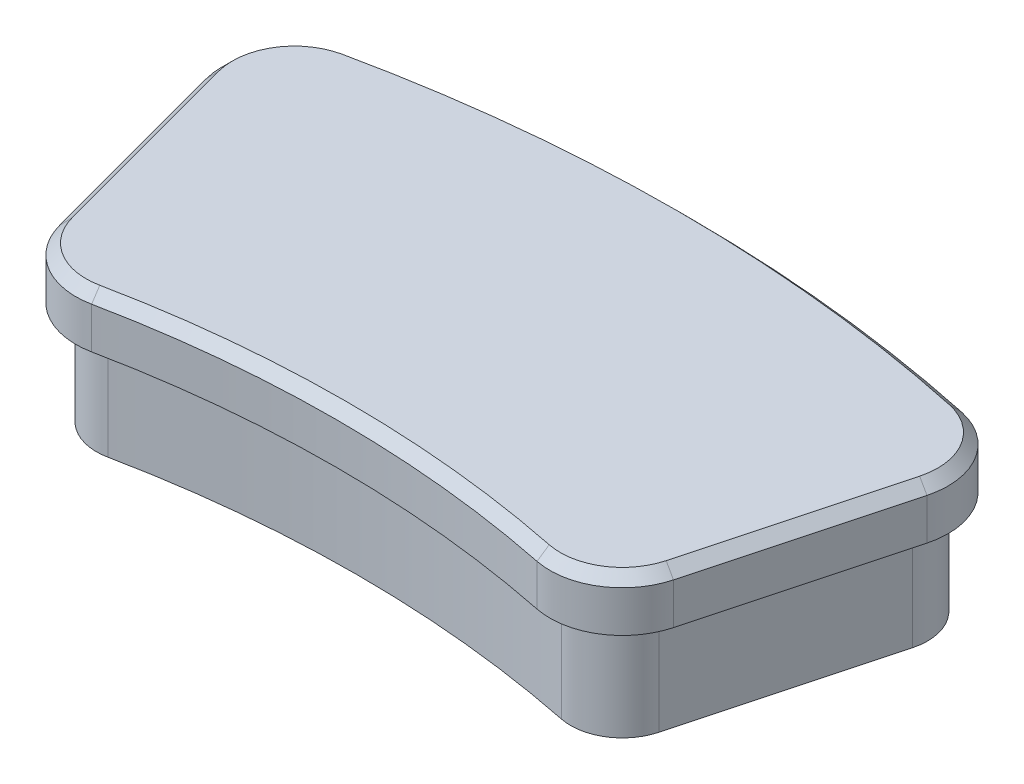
ISO-10303-21;
HEADER;
FILE_DESCRIPTION(('STEP AP214'),'2;1');
FILE_NAME('part.step','',(''),(''),'','','');
FILE_SCHEMA(('AUTOMOTIVE_DESIGN { 1 0 10303 214 1 1 1 1 }'));
ENDSEC;
DATA;
#1=APPLICATION_CONTEXT('core data for automotive mechanical design processes');
#2=APPLICATION_PROTOCOL_DEFINITION('international standard','automotive_design',2000,#1);
#3=PRODUCT_CONTEXT('',#1,'mechanical');
#4=PRODUCT('Part','Part','',(#3));
#5=PRODUCT_RELATED_PRODUCT_CATEGORY('part','',(#4));
#6=PRODUCT_DEFINITION_FORMATION('','',#4);
#7=PRODUCT_DEFINITION_CONTEXT('part definition',#1,'design');
#8=PRODUCT_DEFINITION('design','',#6,#7);
#9=PRODUCT_DEFINITION_SHAPE('','',#8);
#10=(LENGTH_UNIT() NAMED_UNIT(*) SI_UNIT(.MILLI.,.METRE.));
#11=(NAMED_UNIT(*) PLANE_ANGLE_UNIT() SI_UNIT($,.RADIAN.));
#12=(NAMED_UNIT(*) SI_UNIT($,.STERADIAN.) SOLID_ANGLE_UNIT());
#13=UNCERTAINTY_MEASURE_WITH_UNIT(LENGTH_MEASURE(1.E-05),#10,'distance_accuracy_value','');
#14=(GEOMETRIC_REPRESENTATION_CONTEXT(3) GLOBAL_UNCERTAINTY_ASSIGNED_CONTEXT((#13)) GLOBAL_UNIT_ASSIGNED_CONTEXT((#10,
#11,#12)) REPRESENTATION_CONTEXT('',''));
#15=CARTESIAN_POINT('',(0.,0.,0.));
#16=DIRECTION('',(0.,0.,1.));
#17=DIRECTION('',(1.,0.,0.));
#18=AXIS2_PLACEMENT_3D('',#15,#16,#17);
#19=CARTESIAN_POINT('',(0.,15.,0.));
#20=DIRECTION('',(0.,-1.,0.));
#21=DIRECTION('',(0.,0.,-1.));
#22=AXIS2_PLACEMENT_3D('',#19,#20,#21);
#23=CYLINDRICAL_SURFACE('',#22,108.);
#24=DIRECTION('',(0.,-1.,0.));
#25=VECTOR('',#24,1.);
#26=CARTESIAN_POINT('',(21.550713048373,15.,-105.828005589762));
#27=LINE('',#26,#25);
#28=CARTESIAN_POINT('',(21.5507130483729,10.,-105.828005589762));
#29=VERTEX_POINT('',#28);
#30=CARTESIAN_POINT('',(21.550713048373,14.,-105.828005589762));
#31=VERTEX_POINT('',#30);
#32=EDGE_CURVE('E253',#29,#31,#27,.F.);
#33=ORIENTED_EDGE('',*,*,#32,.T.);
#34=CARTESIAN_POINT('',(0.,14.,0.));
#35=DIRECTION('',(0.,1.,0.));
#36=DIRECTION('',(0.,0.,1.));
#37=AXIS2_PLACEMENT_3D('',#34,#35,#36);
#38=CIRCLE('',#37,108.);
#39=CARTESIAN_POINT('',(-21.550713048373,14.,-105.828005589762));
#40=VERTEX_POINT('',#39);
#41=EDGE_CURVE('E59',#31,#40,#38,.T.);
#42=ORIENTED_EDGE('',*,*,#41,.T.);
#43=DIRECTION('',(0.,-1.,0.));
#44=VECTOR('',#43,1.);
#45=CARTESIAN_POINT('',(-21.550713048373,15.,-105.828005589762));
#46=LINE('',#45,#44);
#47=CARTESIAN_POINT('',(-21.5507130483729,10.,-105.828005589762));
#48=VERTEX_POINT('',#47);
#49=EDGE_CURVE('E255',#40,#48,#46,.T.);
#50=ORIENTED_EDGE('',*,*,#49,.T.);
#51=CARTESIAN_POINT('',(0.,10.,0.));
#52=DIRECTION('',(0.,1.,0.));
#53=DIRECTION('',(0.,0.,1.));
#54=AXIS2_PLACEMENT_3D('',#51,#52,#53);
#55=CIRCLE('',#54,108.);
#56=EDGE_CURVE('E222',#48,#29,#55,.F.);
#57=ORIENTED_EDGE('',*,*,#56,.T.);
#58=EDGE_LOOP('',(#33,#42,#50,#57));
#59=FACE_BOUND('',#58,.T.);
#60=ADVANCED_FACE('F35',(#59),#23,.F.);
#61=CARTESIAN_POINT('',(27.9524568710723,15.,-104.319989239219));
#62=DIRECTION('',(-0.965925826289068,0.,-0.258819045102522));
#63=DIRECTION('',(-0.258819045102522,0.,0.965925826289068));
#64=AXIS2_PLACEMENT_3D('',#61,#62,#63);
#65=PLANE('',#64);
#66=DIRECTION('',(0.,-1.,0.));
#67=VECTOR('',#66,1.);
#68=CARTESIAN_POINT('',(34.8935686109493,15.,-130.224570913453));
#69=LINE('',#68,#67);
#70=CARTESIAN_POINT('',(34.8935686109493,10.,-130.224570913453));
#71=VERTEX_POINT('',#70);
#72=CARTESIAN_POINT('',(34.8935686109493,14.,-130.224570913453));
#73=VERTEX_POINT('',#72);
#74=EDGE_CURVE('E274',#71,#73,#69,.F.);
#75=ORIENTED_EDGE('',*,*,#74,.T.);
#76=DIRECTION('',(-0.258819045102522,0.,0.965925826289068));
#77=VECTOR('',#76,1.);
#78=CARTESIAN_POINT('',(29.7089993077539,14.,-110.875494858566));
#79=LINE('',#78,#77);
#80=CARTESIAN_POINT('',(29.7089993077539,14.,-110.875494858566));
#81=VERTEX_POINT('',#80);
#82=EDGE_CURVE('E303',#73,#81,#79,.T.);
#83=ORIENTED_EDGE('',*,*,#82,.T.);
#84=DIRECTION('',(0.,-1.,0.));
#85=VECTOR('',#84,1.);
#86=CARTESIAN_POINT('',(29.7089993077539,15.,-110.875494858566));
#87=LINE('',#86,#85);
#88=CARTESIAN_POINT('',(29.7089993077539,10.,-110.875494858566));
#89=VERTEX_POINT('',#88);
#90=EDGE_CURVE('E277',#81,#89,#87,.T.);
#91=ORIENTED_EDGE('',*,*,#90,.T.);
#92=DIRECTION('',(0.258819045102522,0.,-0.965925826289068));
#93=VECTOR('',#92,1.);
#94=CARTESIAN_POINT('',(27.9524568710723,10.,-104.319989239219));
#95=LINE('',#94,#93);
#96=EDGE_CURVE('E219',#89,#71,#95,.T.);
#97=ORIENTED_EDGE('',*,*,#96,.T.);
#98=EDGE_LOOP('',(#75,#83,#91,#97));
#99=FACE_BOUND('',#98,.T.);
#100=ADVANCED_FACE('F382',(#99),#65,.F.);
#101=CARTESIAN_POINT('',(0.,15.,0.));
#102=DIRECTION('',(0.,-1.,0.));
#103=DIRECTION('',(0.,0.,-1.));
#104=AXIS2_PLACEMENT_3D('',#101,#102,#103);
#105=CYLINDRICAL_SURFACE('',#104,142.);
#106=DIRECTION('',(0.,-1.,0.));
#107=VECTOR('',#106,1.);
#108=CARTESIAN_POINT('',(-29.5907886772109,15.,-138.882631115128));
#109=LINE('',#108,#107);
#110=CARTESIAN_POINT('',(-29.5907886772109,10.,-138.882631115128));
#111=VERTEX_POINT('',#110);
#112=CARTESIAN_POINT('',(-29.5907886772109,14.,-138.882631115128));
#113=VERTEX_POINT('',#112);
#114=EDGE_CURVE('E271',#111,#113,#109,.F.);
#115=ORIENTED_EDGE('',*,*,#114,.T.);
#116=CARTESIAN_POINT('',(0.,14.,0.));
#117=DIRECTION('',(0.,1.,0.));
#118=DIRECTION('',(0.,0.,1.));
#119=AXIS2_PLACEMENT_3D('',#116,#117,#118);
#120=CIRCLE('',#119,142.);
#121=CARTESIAN_POINT('',(29.5907886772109,14.,-138.882631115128));
#122=VERTEX_POINT('',#121);
#123=EDGE_CURVE('E299',#113,#122,#120,.F.);
#124=ORIENTED_EDGE('',*,*,#123,.T.);
#125=DIRECTION('',(0.,-1.,0.));
#126=VECTOR('',#125,1.);
#127=CARTESIAN_POINT('',(29.5907886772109,15.,-138.882631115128));
#128=LINE('',#127,#126);
#129=CARTESIAN_POINT('',(29.5907886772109,10.,-138.882631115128));
#130=VERTEX_POINT('',#129);
#131=EDGE_CURVE('E269',#122,#130,#128,.T.);
#132=ORIENTED_EDGE('',*,*,#131,.T.);
#133=CARTESIAN_POINT('',(0.,10.,0.));
#134=DIRECTION('',(0.,1.,0.));
#135=DIRECTION('',(0.,0.,1.));
#136=AXIS2_PLACEMENT_3D('',#133,#134,#135);
#137=CIRCLE('',#136,142.);
#138=EDGE_CURVE('E216',#130,#111,#137,.T.);
#139=ORIENTED_EDGE('',*,*,#138,.T.);
#140=EDGE_LOOP('',(#115,#124,#132,#139));
#141=FACE_BOUND('',#140,.T.);
#142=ADVANCED_FACE('F367',(#141),#105,.T.);
#143=CARTESIAN_POINT('',(-27.9524568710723,15.,-104.319989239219));
#144=DIRECTION('',(0.965925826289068,0.,-0.258819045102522));
#145=DIRECTION('',(-0.258819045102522,0.,-0.965925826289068));
#146=AXIS2_PLACEMENT_3D('',#143,#144,#145);
#147=PLANE('',#146);
#148=DIRECTION('',(0.,-1.,0.));
#149=VECTOR('',#148,1.);
#150=CARTESIAN_POINT('',(-29.7089993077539,15.,-110.875494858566));
#151=LINE('',#150,#149);
#152=CARTESIAN_POINT('',(-29.7089993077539,10.,-110.875494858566));
#153=VERTEX_POINT('',#152);
#154=CARTESIAN_POINT('',(-29.7089993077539,14.,-110.875494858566));
#155=VERTEX_POINT('',#154);
#156=EDGE_CURVE('E267',#153,#155,#151,.F.);
#157=ORIENTED_EDGE('',*,*,#156,.T.);
#158=DIRECTION('',(-0.258819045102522,0.,-0.965925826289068));
#159=VECTOR('',#158,1.);
#160=CARTESIAN_POINT('',(-34.8935686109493,14.,-130.224570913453));
#161=LINE('',#160,#159);
#162=CARTESIAN_POINT('',(-34.8935686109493,14.,-130.224570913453));
#163=VERTEX_POINT('',#162);
#164=EDGE_CURVE('E12',#155,#163,#161,.T.);
#165=ORIENTED_EDGE('',*,*,#164,.T.);
#166=DIRECTION('',(0.,-1.,0.));
#167=VECTOR('',#166,1.);
#168=CARTESIAN_POINT('',(-34.8935686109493,15.,-130.224570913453));
#169=LINE('',#168,#167);
#170=CARTESIAN_POINT('',(-34.8935686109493,10.,-130.224570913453));
#171=VERTEX_POINT('',#170);
#172=EDGE_CURVE('E265',#163,#171,#169,.T.);
#173=ORIENTED_EDGE('',*,*,#172,.T.);
#174=DIRECTION('',(0.258819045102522,0.,0.965925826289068));
#175=VECTOR('',#174,1.);
#176=CARTESIAN_POINT('',(-27.9524568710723,10.,-104.319989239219));
#177=LINE('',#176,#175);
#178=EDGE_CURVE('E225',#171,#153,#177,.T.);
#179=ORIENTED_EDGE('',*,*,#178,.T.);
#180=EDGE_LOOP('',(#157,#165,#173,#179));
#181=FACE_BOUND('',#180,.T.);
#182=ADVANCED_FACE('F349',(#181),#147,.F.);
#183=CARTESIAN_POINT('',(0.,15.,0.));
#184=DIRECTION('',(0.,1.,0.));
#185=DIRECTION('',(0.,0.,1.));
#186=AXIS2_PLACEMENT_3D('',#183,#184,#185);
#187=PLANE('',#186);
#188=CARTESIAN_POINT('',(0.,15.,0.));
#189=DIRECTION('',(0.,1.,0.));
#190=DIRECTION('',(0.,0.,1.));
#191=AXIS2_PLACEMENT_3D('',#188,#189,#190);
#192=CIRCLE('',#191,141.);
#193=CARTESIAN_POINT('',(29.3824028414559,15.,-137.904584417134));
#194=VERTEX_POINT('',#193);
#195=CARTESIAN_POINT('',(-29.3824028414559,15.,-137.904584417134));
#196=VERTEX_POINT('',#195);
#197=EDGE_CURVE('E291',#194,#196,#192,.T.);
#198=ORIENTED_EDGE('',*,*,#197,.T.);
#199=CARTESIAN_POINT('',(-28.1320878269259,15.,-132.036304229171));
#200=DIRECTION('',(0.,1.,0.));
#201=DIRECTION('',(0.,0.,1.));
#202=AXIS2_PLACEMENT_3D('',#199,#200,#201);
#203=CIRCLE('',#202,6.);
#204=CARTESIAN_POINT('',(-33.9276427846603,15.,-130.483389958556));
#205=VERTEX_POINT('',#204);
#206=EDGE_CURVE('E293',#196,#205,#203,.T.);
#207=ORIENTED_EDGE('',*,*,#206,.T.);
#208=DIRECTION('',(0.258819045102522,0.,0.965925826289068));
#209=VECTOR('',#208,1.);
#210=CARTESIAN_POINT('',(-28.7430734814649,15.,-111.134313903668));
#211=LINE('',#210,#209);
#212=CARTESIAN_POINT('',(-28.7430734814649,15.,-111.134313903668));
#213=VERTEX_POINT('',#212);
#214=EDGE_CURVE('E279',#205,#213,#211,.T.);
#215=ORIENTED_EDGE('',*,*,#214,.T.);
#216=CARTESIAN_POINT('',(-22.9475185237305,15.,-112.687228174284));
#217=DIRECTION('',(0.,1.,0.));
#218=DIRECTION('',(0.,0.,1.));
#219=AXIS2_PLACEMENT_3D('',#216,#217,#218);
#220=CIRCLE('',#219,6.);
#221=CARTESIAN_POINT('',(-21.7502566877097,15.,-106.807894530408));
#222=VERTEX_POINT('',#221);
#223=EDGE_CURVE('E281',#213,#222,#220,.T.);
#224=ORIENTED_EDGE('',*,*,#223,.T.);
#225=CARTESIAN_POINT('',(0.,15.,0.));
#226=DIRECTION('',(0.,1.,0.));
#227=DIRECTION('',(0.,0.,1.));
#228=AXIS2_PLACEMENT_3D('',#225,#226,#227);
#229=CIRCLE('',#228,109.);
#230=CARTESIAN_POINT('',(21.7502566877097,15.,-106.807894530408));
#231=VERTEX_POINT('',#230);
#232=EDGE_CURVE('E283',#222,#231,#229,.F.);
#233=ORIENTED_EDGE('',*,*,#232,.T.);
#234=CARTESIAN_POINT('',(22.9475185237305,15.,-112.687228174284));
#235=DIRECTION('',(0.,1.,0.));
#236=DIRECTION('',(0.,0.,1.));
#237=AXIS2_PLACEMENT_3D('',#234,#235,#236);
#238=CIRCLE('',#237,6.);
#239=CARTESIAN_POINT('',(28.7430734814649,15.,-111.134313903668));
#240=VERTEX_POINT('',#239);
#241=EDGE_CURVE('E285',#231,#240,#238,.T.);
#242=ORIENTED_EDGE('',*,*,#241,.T.);
#243=DIRECTION('',(0.258819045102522,0.,-0.965925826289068));
#244=VECTOR('',#243,1.);
#245=CARTESIAN_POINT('',(33.9276427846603,15.,-130.483389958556));
#246=LINE('',#245,#244);
#247=CARTESIAN_POINT('',(33.9276427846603,15.,-130.483389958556));
#248=VERTEX_POINT('',#247);
#249=EDGE_CURVE('E287',#240,#248,#246,.T.);
#250=ORIENTED_EDGE('',*,*,#249,.T.);
#251=CARTESIAN_POINT('',(28.1320878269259,15.,-132.036304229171));
#252=DIRECTION('',(0.,1.,0.));
#253=DIRECTION('',(0.,0.,1.));
#254=AXIS2_PLACEMENT_3D('',#251,#252,#253);
#255=CIRCLE('',#254,6.);
#256=EDGE_CURVE('E289',#248,#194,#255,.T.);
#257=ORIENTED_EDGE('',*,*,#256,.T.);
#258=EDGE_LOOP('',(#198,#207,#215,#224,#233,#242,#250,#257));
#259=FACE_BOUND('',#258,.T.);
#260=ADVANCED_FACE('F336',(#259),#187,.T.);
#261=CARTESIAN_POINT('',(0.,10.,-123.15999461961));
#262=DIRECTION('',(0.,1.,0.));
#263=DIRECTION('',(0.,0.,1.));
#264=AXIS2_PLACEMENT_3D('',#261,#262,#263);
#265=PLANE('',#264);
#266=CARTESIAN_POINT('',(0.,10.,0.));
#267=DIRECTION('',(0.,-1.,0.));
#268=DIRECTION('',(0.,0.,1.));
#269=AXIS2_PLACEMENT_3D('',#266,#267,#268);
#270=CIRCLE('',#269,110.);
#271=CARTESIAN_POINT('',(-21.9498003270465,10.,-107.787783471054));
#272=VERTEX_POINT('',#271);
#273=CARTESIAN_POINT('',(21.9498003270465,10.,-107.787783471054));
#274=VERTEX_POINT('',#273);
#275=EDGE_CURVE('E194',#272,#274,#270,.T.);
#276=ORIENTED_EDGE('',*,*,#275,.T.);
#277=CARTESIAN_POINT('',(22.9475185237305,10.,-112.687228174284));
#278=DIRECTION('',(0.,1.,0.));
#279=DIRECTION('',(0.,0.,1.));
#280=AXIS2_PLACEMENT_3D('',#277,#278,#279);
#281=CIRCLE('',#280,5.);
#282=CARTESIAN_POINT('',(27.7771476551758,10.,-111.393132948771));
#283=VERTEX_POINT('',#282);
#284=EDGE_CURVE('E249',#274,#283,#281,.T.);
#285=ORIENTED_EDGE('',*,*,#284,.T.);
#286=DIRECTION('',(0.258819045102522,0.,-0.965925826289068));
#287=VECTOR('',#286,1.);
#288=CARTESIAN_POINT('',(26.5335371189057,10.,-106.751915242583));
#289=LINE('',#288,#287);
#290=CARTESIAN_POINT('',(32.9617169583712,10.,-130.742209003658));
#291=VERTEX_POINT('',#290);
#292=EDGE_CURVE('E624',#283,#291,#289,.T.);
#293=ORIENTED_EDGE('',*,*,#292,.T.);
#294=CARTESIAN_POINT('',(28.1320878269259,10.,-132.036304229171));
#295=DIRECTION('',(0.,1.,0.));
#296=DIRECTION('',(0.,0.,1.));
#297=AXIS2_PLACEMENT_3D('',#294,#295,#296);
#298=CIRCLE('',#297,5.);
#299=CARTESIAN_POINT('',(29.1740170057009,10.,-136.92653771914));
#300=VERTEX_POINT('',#299);
#301=EDGE_CURVE('E251',#291,#300,#298,.T.);
#302=ORIENTED_EDGE('',*,*,#301,.T.);
#303=CARTESIAN_POINT('',(0.,10.,0.));
#304=DIRECTION('',(0.,1.,0.));
#305=DIRECTION('',(0.,0.,1.));
#306=AXIS2_PLACEMENT_3D('',#303,#304,#305);
#307=CIRCLE('',#306,140.);
#308=CARTESIAN_POINT('',(-29.1740170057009,10.,-136.92653771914));
#309=VERTEX_POINT('',#308);
#310=EDGE_CURVE('E634',#300,#309,#307,.T.);
#311=ORIENTED_EDGE('',*,*,#310,.T.);
#312=CARTESIAN_POINT('',(-28.1320878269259,10.,-132.036304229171));
#313=DIRECTION('',(0.,1.,0.));
#314=DIRECTION('',(0.,0.,1.));
#315=AXIS2_PLACEMENT_3D('',#312,#313,#314);
#316=CIRCLE('',#315,5.);
#317=CARTESIAN_POINT('',(-32.9617169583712,10.,-130.742209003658));
#318=VERTEX_POINT('',#317);
#319=EDGE_CURVE('E247',#309,#318,#316,.T.);
#320=ORIENTED_EDGE('',*,*,#319,.T.);
#321=DIRECTION('',(0.258819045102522,0.,0.965925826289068));
#322=VECTOR('',#321,1.);
#323=CARTESIAN_POINT('',(-34.299117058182,10.,-135.7334541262));
#324=LINE('',#323,#322);
#325=CARTESIAN_POINT('',(-27.7771476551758,10.,-111.393132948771));
#326=VERTEX_POINT('',#325);
#327=EDGE_CURVE('E209',#318,#326,#324,.T.);
#328=ORIENTED_EDGE('',*,*,#327,.T.);
#329=CARTESIAN_POINT('',(-22.9475185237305,10.,-112.687228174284));
#330=DIRECTION('',(0.,1.,0.));
#331=DIRECTION('',(0.,0.,1.));
#332=AXIS2_PLACEMENT_3D('',#329,#330,#331);
#333=CIRCLE('',#332,5.);
#334=EDGE_CURVE('E245',#326,#272,#333,.T.);
#335=ORIENTED_EDGE('',*,*,#334,.T.);
#336=EDGE_LOOP('',(#276,#285,#293,#302,#311,#320,#328,#335));
#337=FACE_BOUND('',#336,.T.);
#338=ORIENTED_EDGE('',*,*,#56,.F.);
#339=CARTESIAN_POINT('',(-22.9475185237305,10.,-112.687228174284));
#340=DIRECTION('',(0.,1.,0.));
#341=DIRECTION('',(0.,0.,1.));
#342=AXIS2_PLACEMENT_3D('',#339,#340,#341);
#343=CIRCLE('',#342,7.);
#344=EDGE_CURVE('E263',#48,#153,#343,.F.);
#345=ORIENTED_EDGE('',*,*,#344,.T.);
#346=ORIENTED_EDGE('',*,*,#178,.F.);
#347=CARTESIAN_POINT('',(-28.1320878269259,10.,-132.036304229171));
#348=DIRECTION('',(0.,1.,0.));
#349=DIRECTION('',(0.,0.,1.));
#350=AXIS2_PLACEMENT_3D('',#347,#348,#349);
#351=CIRCLE('',#350,7.);
#352=EDGE_CURVE('E261',#171,#111,#351,.F.);
#353=ORIENTED_EDGE('',*,*,#352,.T.);
#354=ORIENTED_EDGE('',*,*,#138,.F.);
#355=CARTESIAN_POINT('',(28.1320878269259,10.,-132.036304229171));
#356=DIRECTION('',(0.,1.,0.));
#357=DIRECTION('',(0.,0.,1.));
#358=AXIS2_PLACEMENT_3D('',#355,#356,#357);
#359=CIRCLE('',#358,7.);
#360=EDGE_CURVE('E257',#130,#71,#359,.F.);
#361=ORIENTED_EDGE('',*,*,#360,.T.);
#362=ORIENTED_EDGE('',*,*,#96,.F.);
#363=CARTESIAN_POINT('',(22.9475185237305,10.,-112.687228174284));
#364=DIRECTION('',(0.,1.,0.));
#365=DIRECTION('',(0.,0.,1.));
#366=AXIS2_PLACEMENT_3D('',#363,#364,#365);
#367=CIRCLE('',#366,7.);
#368=EDGE_CURVE('E259',#89,#29,#367,.F.);
#369=ORIENTED_EDGE('',*,*,#368,.T.);
#370=EDGE_LOOP('',(#338,#345,#346,#353,#354,#361,#362,#369));
#371=FACE_BOUND('',#370,.T.);
#372=ADVANCED_FACE('F390',(#337,#371),#265,.F.);
#373=CARTESIAN_POINT('',(0.,10.,0.));
#374=DIRECTION('',(0.,-1.,0.));
#375=DIRECTION('',(0.,0.,-1.));
#376=AXIS2_PLACEMENT_3D('',#373,#374,#375);
#377=CYLINDRICAL_SURFACE('',#376,110.);
#378=ORIENTED_EDGE('',*,*,#275,.F.);
#379=DIRECTION('',(0.,-1.,0.));
#380=VECTOR('',#379,1.);
#381=CARTESIAN_POINT('',(-21.9498003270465,10.,-107.787783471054));
#382=LINE('',#381,#380);
#383=CARTESIAN_POINT('',(-21.9498003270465,0.,-107.787783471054));
#384=VERTEX_POINT('',#383);
#385=EDGE_CURVE('E178',#272,#384,#382,.T.);
#386=ORIENTED_EDGE('',*,*,#385,.T.);
#387=CARTESIAN_POINT('',(0.,0.,0.));
#388=DIRECTION('',(0.,-1.,0.));
#389=DIRECTION('',(0.,0.,1.));
#390=AXIS2_PLACEMENT_3D('',#387,#388,#389);
#391=CIRCLE('',#390,110.);
#392=CARTESIAN_POINT('',(21.9498003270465,0.,-107.787783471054));
#393=VERTEX_POINT('',#392);
#394=EDGE_CURVE('E191',#384,#393,#391,.T.);
#395=ORIENTED_EDGE('',*,*,#394,.T.);
#396=DIRECTION('',(0.,-1.,0.));
#397=VECTOR('',#396,1.);
#398=CARTESIAN_POINT('',(21.9498003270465,10.,-107.787783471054));
#399=LINE('',#398,#397);
#400=EDGE_CURVE('E196',#393,#274,#399,.F.);
#401=ORIENTED_EDGE('',*,*,#400,.T.);
#402=EDGE_LOOP('',(#378,#386,#395,#401));
#403=FACE_BOUND('',#402,.T.);
#404=ADVANCED_FACE('F190',(#403),#377,.F.);
#405=CARTESIAN_POINT('',(26.5335371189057,10.,-106.751915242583));
#406=DIRECTION('',(-0.965925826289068,0.,-0.258819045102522));
#407=DIRECTION('',(-0.258819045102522,0.,0.965925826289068));
#408=AXIS2_PLACEMENT_3D('',#405,#406,#407);
#409=PLANE('',#408);
#410=ORIENTED_EDGE('',*,*,#292,.F.);
#411=DIRECTION('',(0.,-1.,0.));
#412=VECTOR('',#411,1.);
#413=CARTESIAN_POINT('',(27.7771476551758,10.,-111.393132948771));
#414=LINE('',#413,#412);
#415=CARTESIAN_POINT('',(27.7771476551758,0.,-111.393132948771));
#416=VERTEX_POINT('',#415);
#417=EDGE_CURVE('E242',#283,#416,#414,.T.);
#418=ORIENTED_EDGE('',*,*,#417,.T.);
#419=DIRECTION('',(0.258819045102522,0.,-0.965925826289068));
#420=VECTOR('',#419,1.);
#421=CARTESIAN_POINT('',(26.5335371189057,0.,-106.751915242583));
#422=LINE('',#421,#420);
#423=CARTESIAN_POINT('',(32.9617169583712,0.,-130.742209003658));
#424=VERTEX_POINT('',#423);
#425=EDGE_CURVE('E201',#416,#424,#422,.T.);
#426=ORIENTED_EDGE('',*,*,#425,.T.);
#427=DIRECTION('',(0.,-1.,0.));
#428=VECTOR('',#427,1.);
#429=CARTESIAN_POINT('',(32.9617169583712,10.,-130.742209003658));
#430=LINE('',#429,#428);
#431=EDGE_CURVE('E240',#424,#291,#430,.F.);
#432=ORIENTED_EDGE('',*,*,#431,.T.);
#433=EDGE_LOOP('',(#410,#418,#426,#432));
#434=FACE_BOUND('',#433,.T.);
#435=ADVANCED_FACE('F495',(#434),#409,.F.);
#436=CARTESIAN_POINT('',(0.,10.,0.));
#437=DIRECTION('',(0.,-1.,0.));
#438=DIRECTION('',(0.,0.,-1.));
#439=AXIS2_PLACEMENT_3D('',#436,#437,#438);
#440=CYLINDRICAL_SURFACE('',#439,140.);
#441=CARTESIAN_POINT('',(0.,0.,0.));
#442=DIRECTION('',(0.,1.,0.));
#443=DIRECTION('',(0.,0.,1.));
#444=AXIS2_PLACEMENT_3D('',#441,#442,#443);
#445=CIRCLE('',#444,140.);
#446=CARTESIAN_POINT('',(29.1740170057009,0.,-136.92653771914));
#447=VERTEX_POINT('',#446);
#448=CARTESIAN_POINT('',(-29.1740170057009,0.,-136.92653771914));
#449=VERTEX_POINT('',#448);
#450=EDGE_CURVE('E204',#447,#449,#445,.T.);
#451=ORIENTED_EDGE('',*,*,#450,.T.);
#452=DIRECTION('',(0.,-1.,0.));
#453=VECTOR('',#452,1.);
#454=CARTESIAN_POINT('',(-29.1740170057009,10.,-136.92653771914));
#455=LINE('',#454,#453);
#456=EDGE_CURVE('E238',#449,#309,#455,.F.);
#457=ORIENTED_EDGE('',*,*,#456,.T.);
#458=ORIENTED_EDGE('',*,*,#310,.F.);
#459=DIRECTION('',(0.,-1.,0.));
#460=VECTOR('',#459,1.);
#461=CARTESIAN_POINT('',(29.1740170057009,10.,-136.92653771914));
#462=LINE('',#461,#460);
#463=EDGE_CURVE('E235',#300,#447,#462,.T.);
#464=ORIENTED_EDGE('',*,*,#463,.T.);
#465=EDGE_LOOP('',(#451,#457,#458,#464));
#466=FACE_BOUND('',#465,.T.);
#467=ADVANCED_FACE('F487',(#466),#440,.T.);
#468=CARTESIAN_POINT('',(-34.299117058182,10.,-135.7334541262));
#469=DIRECTION('',(0.965925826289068,0.,-0.258819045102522));
#470=DIRECTION('',(-0.258819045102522,0.,-0.965925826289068));
#471=AXIS2_PLACEMENT_3D('',#468,#469,#470);
#472=PLANE('',#471);
#473=DIRECTION('',(0.258819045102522,0.,0.965925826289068));
#474=VECTOR('',#473,1.);
#475=CARTESIAN_POINT('',(-34.299117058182,0.,-135.7334541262));
#476=LINE('',#475,#474);
#477=CARTESIAN_POINT('',(-32.9617169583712,0.,-130.742209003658));
#478=VERTEX_POINT('',#477);
#479=CARTESIAN_POINT('',(-27.7771476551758,0.,-111.393132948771));
#480=VERTEX_POINT('',#479);
#481=EDGE_CURVE('E214',#478,#480,#476,.T.);
#482=ORIENTED_EDGE('',*,*,#481,.T.);
#483=DIRECTION('',(0.,-1.,0.));
#484=VECTOR('',#483,1.);
#485=CARTESIAN_POINT('',(-27.7771476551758,10.,-111.393132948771));
#486=LINE('',#485,#484);
#487=EDGE_CURVE('E179',#480,#326,#486,.F.);
#488=ORIENTED_EDGE('',*,*,#487,.T.);
#489=ORIENTED_EDGE('',*,*,#327,.F.);
#490=DIRECTION('',(0.,-1.,0.));
#491=VECTOR('',#490,1.);
#492=CARTESIAN_POINT('',(-32.9617169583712,10.,-130.742209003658));
#493=LINE('',#492,#491);
#494=EDGE_CURVE('E184',#318,#478,#493,.T.);
#495=ORIENTED_EDGE('',*,*,#494,.T.);
#496=EDGE_LOOP('',(#482,#488,#489,#495));
#497=FACE_BOUND('',#496,.T.);
#498=ADVANCED_FACE('F480',(#497),#472,.F.);
#499=CARTESIAN_POINT('',(0.,0.,0.));
#500=DIRECTION('',(0.,1.,0.));
#501=DIRECTION('',(0.,0.,1.));
#502=AXIS2_PLACEMENT_3D('',#499,#500,#501);
#503=PLANE('',#502);
#504=ORIENTED_EDGE('',*,*,#394,.F.);
#505=CARTESIAN_POINT('',(-22.9475185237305,0.,-112.687228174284));
#506=DIRECTION('',(0.,1.,0.));
#507=DIRECTION('',(0.,0.,1.));
#508=AXIS2_PLACEMENT_3D('',#505,#506,#507);
#509=CIRCLE('',#508,5.);
#510=EDGE_CURVE('E174',#384,#480,#509,.F.);
#511=ORIENTED_EDGE('',*,*,#510,.T.);
#512=ORIENTED_EDGE('',*,*,#481,.F.);
#513=CARTESIAN_POINT('',(-28.1320878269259,0.,-132.036304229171));
#514=DIRECTION('',(0.,1.,0.));
#515=DIRECTION('',(0.,0.,1.));
#516=AXIS2_PLACEMENT_3D('',#513,#514,#515);
#517=CIRCLE('',#516,5.);
#518=EDGE_CURVE('E185',#478,#449,#517,.F.);
#519=ORIENTED_EDGE('',*,*,#518,.T.);
#520=ORIENTED_EDGE('',*,*,#450,.F.);
#521=CARTESIAN_POINT('',(28.1320878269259,0.,-132.036304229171));
#522=DIRECTION('',(0.,1.,0.));
#523=DIRECTION('',(0.,0.,1.));
#524=AXIS2_PLACEMENT_3D('',#521,#522,#523);
#525=CIRCLE('',#524,5.);
#526=EDGE_CURVE('E195',#447,#424,#525,.F.);
#527=ORIENTED_EDGE('',*,*,#526,.T.);
#528=ORIENTED_EDGE('',*,*,#425,.F.);
#529=CARTESIAN_POINT('',(22.9475185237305,0.,-112.687228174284));
#530=DIRECTION('',(0.,1.,0.));
#531=DIRECTION('',(0.,0.,1.));
#532=AXIS2_PLACEMENT_3D('',#529,#530,#531);
#533=CIRCLE('',#532,5.);
#534=EDGE_CURVE('E200',#416,#393,#533,.F.);
#535=ORIENTED_EDGE('',*,*,#534,.T.);
#536=EDGE_LOOP('',(#504,#511,#512,#519,#520,#527,#528,#535));
#537=FACE_BOUND('',#536,.T.);
#538=ADVANCED_FACE('F198',(#537),#503,.F.);
#539=CARTESIAN_POINT('',(-22.9475185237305,10.,-112.687228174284));
#540=DIRECTION('',(0.,-1.,0.));
#541=DIRECTION('',(0.,0.,-1.));
#542=AXIS2_PLACEMENT_3D('',#539,#540,#541);
#543=CYLINDRICAL_SURFACE('',#542,5.);
#544=ORIENTED_EDGE('',*,*,#334,.F.);
#545=ORIENTED_EDGE('',*,*,#487,.F.);
#546=ORIENTED_EDGE('',*,*,#510,.F.);
#547=ORIENTED_EDGE('',*,*,#385,.F.);
#548=EDGE_LOOP('',(#544,#545,#546,#547));
#549=FACE_BOUND('',#548,.T.);
#550=ADVANCED_FACE('F177',(#549),#543,.T.);
#551=CARTESIAN_POINT('',(-28.1320878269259,10.,-132.036304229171));
#552=DIRECTION('',(0.,-1.,0.));
#553=DIRECTION('',(0.,0.,-1.));
#554=AXIS2_PLACEMENT_3D('',#551,#552,#553);
#555=CYLINDRICAL_SURFACE('',#554,5.);
#556=ORIENTED_EDGE('',*,*,#319,.F.);
#557=ORIENTED_EDGE('',*,*,#456,.F.);
#558=ORIENTED_EDGE('',*,*,#518,.F.);
#559=ORIENTED_EDGE('',*,*,#494,.F.);
#560=EDGE_LOOP('',(#556,#557,#558,#559));
#561=FACE_BOUND('',#560,.T.);
#562=ADVANCED_FACE('F403',(#561),#555,.T.);
#563=CARTESIAN_POINT('',(22.9475185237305,10.,-112.687228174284));
#564=DIRECTION('',(0.,-1.,0.));
#565=DIRECTION('',(0.,0.,-1.));
#566=AXIS2_PLACEMENT_3D('',#563,#564,#565);
#567=CYLINDRICAL_SURFACE('',#566,5.);
#568=ORIENTED_EDGE('',*,*,#284,.F.);
#569=ORIENTED_EDGE('',*,*,#400,.F.);
#570=ORIENTED_EDGE('',*,*,#534,.F.);
#571=ORIENTED_EDGE('',*,*,#417,.F.);
#572=EDGE_LOOP('',(#568,#569,#570,#571));
#573=FACE_BOUND('',#572,.T.);
#574=ADVANCED_FACE('F406',(#573),#567,.T.);
#575=CARTESIAN_POINT('',(28.1320878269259,10.,-132.036304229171));
#576=DIRECTION('',(0.,-1.,0.));
#577=DIRECTION('',(0.,0.,-1.));
#578=AXIS2_PLACEMENT_3D('',#575,#576,#577);
#579=CYLINDRICAL_SURFACE('',#578,5.);
#580=ORIENTED_EDGE('',*,*,#301,.F.);
#581=ORIENTED_EDGE('',*,*,#431,.F.);
#582=ORIENTED_EDGE('',*,*,#526,.F.);
#583=ORIENTED_EDGE('',*,*,#463,.F.);
#584=EDGE_LOOP('',(#580,#581,#582,#583));
#585=FACE_BOUND('',#584,.T.);
#586=ADVANCED_FACE('F410',(#585),#579,.T.);
#587=CARTESIAN_POINT('',(-22.9475185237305,15.,-112.687228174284));
#588=DIRECTION('',(0.,-1.,0.));
#589=DIRECTION('',(0.,0.,-1.));
#590=AXIS2_PLACEMENT_3D('',#587,#588,#589);
#591=CYLINDRICAL_SURFACE('',#590,7.);
#592=ORIENTED_EDGE('',*,*,#49,.F.);
#593=CARTESIAN_POINT('',(-22.9475185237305,14.,-112.687228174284));
#594=DIRECTION('',(0.,1.,0.));
#595=DIRECTION('',(0.,0.,1.));
#596=AXIS2_PLACEMENT_3D('',#593,#594,#595);
#597=CIRCLE('',#596,7.);
#598=EDGE_CURVE('E44',#40,#155,#597,.F.);
#599=ORIENTED_EDGE('',*,*,#598,.T.);
#600=ORIENTED_EDGE('',*,*,#156,.F.);
#601=ORIENTED_EDGE('',*,*,#344,.F.);
#602=EDGE_LOOP('',(#592,#599,#600,#601));
#603=FACE_BOUND('',#602,.T.);
#604=ADVANCED_FACE('F392',(#603),#591,.T.);
#605=CARTESIAN_POINT('',(-28.1320878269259,15.,-132.036304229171));
#606=DIRECTION('',(0.,-1.,0.));
#607=DIRECTION('',(0.,0.,-1.));
#608=AXIS2_PLACEMENT_3D('',#605,#606,#607);
#609=CYLINDRICAL_SURFACE('',#608,7.);
#610=ORIENTED_EDGE('',*,*,#172,.F.);
#611=CARTESIAN_POINT('',(-28.1320878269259,14.,-132.036304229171));
#612=DIRECTION('',(0.,1.,0.));
#613=DIRECTION('',(0.,0.,1.));
#614=AXIS2_PLACEMENT_3D('',#611,#612,#613);
#615=CIRCLE('',#614,7.);
#616=EDGE_CURVE('E296',#163,#113,#615,.F.);
#617=ORIENTED_EDGE('',*,*,#616,.T.);
#618=ORIENTED_EDGE('',*,*,#114,.F.);
#619=ORIENTED_EDGE('',*,*,#352,.F.);
#620=EDGE_LOOP('',(#610,#617,#618,#619));
#621=FACE_BOUND('',#620,.T.);
#622=ADVANCED_FACE('F353',(#621),#609,.T.);
#623=CARTESIAN_POINT('',(22.9475185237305,15.,-112.687228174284));
#624=DIRECTION('',(0.,-1.,0.));
#625=DIRECTION('',(0.,0.,-1.));
#626=AXIS2_PLACEMENT_3D('',#623,#624,#625);
#627=CYLINDRICAL_SURFACE('',#626,7.);
#628=ORIENTED_EDGE('',*,*,#90,.F.);
#629=CARTESIAN_POINT('',(22.9475185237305,14.,-112.687228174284));
#630=DIRECTION('',(0.,1.,0.));
#631=DIRECTION('',(0.,0.,1.));
#632=AXIS2_PLACEMENT_3D('',#629,#630,#631);
#633=CIRCLE('',#632,7.);
#634=EDGE_CURVE('E305',#81,#31,#633,.F.);
#635=ORIENTED_EDGE('',*,*,#634,.T.);
#636=ORIENTED_EDGE('',*,*,#32,.F.);
#637=ORIENTED_EDGE('',*,*,#368,.F.);
#638=EDGE_LOOP('',(#628,#635,#636,#637));
#639=FACE_BOUND('',#638,.T.);
#640=ADVANCED_FACE('F385',(#639),#627,.T.);
#641=CARTESIAN_POINT('',(28.1320878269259,15.,-132.036304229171));
#642=DIRECTION('',(0.,-1.,0.));
#643=DIRECTION('',(0.,0.,-1.));
#644=AXIS2_PLACEMENT_3D('',#641,#642,#643);
#645=CYLINDRICAL_SURFACE('',#644,7.);
#646=ORIENTED_EDGE('',*,*,#131,.F.);
#647=CARTESIAN_POINT('',(28.1320878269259,14.,-132.036304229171));
#648=DIRECTION('',(0.,1.,0.));
#649=DIRECTION('',(0.,0.,1.));
#650=AXIS2_PLACEMENT_3D('',#647,#648,#649);
#651=CIRCLE('',#650,7.);
#652=EDGE_CURVE('E301',#122,#73,#651,.F.);
#653=ORIENTED_EDGE('',*,*,#652,.T.);
#654=ORIENTED_EDGE('',*,*,#74,.F.);
#655=ORIENTED_EDGE('',*,*,#360,.F.);
#656=EDGE_LOOP('',(#646,#653,#654,#655));
#657=FACE_BOUND('',#656,.T.);
#658=ADVANCED_FACE('F371',(#657),#645,.T.);
#659=CARTESIAN_POINT('',(22.9475185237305,15.,-112.687228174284));
#660=DIRECTION('',(0.,-1.,0.));
#661=DIRECTION('',(0.,0.,-1.));
#662=AXIS2_PLACEMENT_3D('',#659,#660,#661);
#663=CONICAL_SURFACE('',#662,6.,0.785398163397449);
#664=DIRECTION('',(0.141098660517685,0.707106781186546,-0.692886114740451));
#665=VECTOR('',#664,1.);
#666=CARTESIAN_POINT('',(21.5507130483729,14.,-105.828005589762));
#667=LINE('',#666,#665);
#668=EDGE_CURVE('E207',#31,#231,#667,.T.);
#669=ORIENTED_EDGE('',*,*,#668,.F.);
#670=ORIENTED_EDGE('',*,*,#634,.F.);
#671=DIRECTION('',(0.683012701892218,-0.707106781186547,0.183012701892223));
#672=VECTOR('',#671,1.);
#673=CARTESIAN_POINT('',(28.7430734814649,15.,-111.134313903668));
#674=LINE('',#673,#672);
#675=EDGE_CURVE('E39',#240,#81,#674,.T.);
#676=ORIENTED_EDGE('',*,*,#675,.F.);
#677=ORIENTED_EDGE('',*,*,#241,.F.);
#678=EDGE_LOOP('',(#669,#670,#676,#677));
#679=FACE_BOUND('',#678,.T.);
#680=ADVANCED_FACE('F37',(#679),#663,.T.);
#681=CARTESIAN_POINT('',(-0.965925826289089,15.,-0.258819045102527));
#682=DIRECTION('',(0.683012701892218,0.707106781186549,0.18301270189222));
#683=DIRECTION('',(-0.719254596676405,0.694746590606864,0.));
#684=AXIS2_PLACEMENT_3D('',#681,#682,#683);
#685=PLANE('',#684);
#686=ORIENTED_EDGE('',*,*,#675,.T.);
#687=ORIENTED_EDGE('',*,*,#82,.F.);
#688=DIRECTION('',(0.683012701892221,-0.707106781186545,0.183012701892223));
#689=VECTOR('',#688,1.);
#690=CARTESIAN_POINT('',(33.9276427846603,15.,-130.483389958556));
#691=LINE('',#690,#689);
#692=EDGE_CURVE('E322',#248,#73,#691,.T.);
#693=ORIENTED_EDGE('',*,*,#692,.F.);
#694=ORIENTED_EDGE('',*,*,#249,.F.);
#695=EDGE_LOOP('',(#686,#687,#693,#694));
#696=FACE_BOUND('',#695,.T.);
#697=ADVANCED_FACE('F379',(#696),#685,.T.);
#698=CARTESIAN_POINT('',(0.,15.,0.));
#699=DIRECTION('',(0.,1.,0.));
#700=DIRECTION('',(0.,0.,1.));
#701=AXIS2_PLACEMENT_3D('',#698,#699,#700);
#702=CONICAL_SURFACE('',#701,109.,0.785398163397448);
#703=ORIENTED_EDGE('',*,*,#668,.T.);
#704=ORIENTED_EDGE('',*,*,#232,.F.);
#705=DIRECTION('',(-0.141098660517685,0.707106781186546,-0.692886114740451));
#706=VECTOR('',#705,1.);
#707=CARTESIAN_POINT('',(-21.5507130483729,14.,-105.828005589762));
#708=LINE('',#707,#706);
#709=EDGE_CURVE('E319',#40,#222,#708,.T.);
#710=ORIENTED_EDGE('',*,*,#709,.F.);
#711=ORIENTED_EDGE('',*,*,#41,.F.);
#712=EDGE_LOOP('',(#703,#704,#710,#711));
#713=FACE_BOUND('',#712,.T.);
#714=ADVANCED_FACE('F328',(#713),#702,.F.);
#715=CARTESIAN_POINT('',(28.1320878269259,15.,-132.036304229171));
#716=DIRECTION('',(0.,-1.,0.));
#717=DIRECTION('',(0.,0.,-1.));
#718=AXIS2_PLACEMENT_3D('',#715,#716,#717);
#719=CONICAL_SURFACE('',#718,6.,0.78539816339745);
#720=ORIENTED_EDGE('',*,*,#692,.T.);
#721=ORIENTED_EDGE('',*,*,#652,.F.);
#722=DIRECTION('',(0.147351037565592,-0.707106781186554,-0.691583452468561));
#723=VECTOR('',#722,1.);
#724=CARTESIAN_POINT('',(29.3824028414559,15.,-137.904584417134));
#725=LINE('',#724,#723);
#726=EDGE_CURVE('E316',#194,#122,#725,.T.);
#727=ORIENTED_EDGE('',*,*,#726,.F.);
#728=ORIENTED_EDGE('',*,*,#256,.F.);
#729=EDGE_LOOP('',(#720,#721,#727,#728));
#730=FACE_BOUND('',#729,.T.);
#731=ADVANCED_FACE('F375',(#730),#719,.T.);
#732=CARTESIAN_POINT('',(-22.9475185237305,15.,-112.687228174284));
#733=DIRECTION('',(0.,-1.,0.));
#734=DIRECTION('',(0.,0.,-1.));
#735=AXIS2_PLACEMENT_3D('',#732,#733,#734);
#736=CONICAL_SURFACE('',#735,5.99999999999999,0.78539816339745);
#737=ORIENTED_EDGE('',*,*,#709,.T.);
#738=ORIENTED_EDGE('',*,*,#223,.F.);
#739=DIRECTION('',(0.68301270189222,0.707106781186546,-0.183012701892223));
#740=VECTOR('',#739,1.);
#741=CARTESIAN_POINT('',(-29.7089993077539,14.,-110.875494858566));
#742=LINE('',#741,#740);
#743=EDGE_CURVE('E313',#155,#213,#742,.T.);
#744=ORIENTED_EDGE('',*,*,#743,.F.);
#745=ORIENTED_EDGE('',*,*,#598,.F.);
#746=EDGE_LOOP('',(#737,#738,#744,#745));
#747=FACE_BOUND('',#746,.T.);
#748=ADVANCED_FACE('F342',(#747),#736,.T.);
#749=CARTESIAN_POINT('',(0.,15.,0.));
#750=DIRECTION('',(0.,-1.,0.));
#751=DIRECTION('',(0.,0.,-1.));
#752=AXIS2_PLACEMENT_3D('',#749,#750,#751);
#753=CONICAL_SURFACE('',#752,141.,0.785398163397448);
#754=ORIENTED_EDGE('',*,*,#726,.T.);
#755=ORIENTED_EDGE('',*,*,#123,.F.);
#756=DIRECTION('',(-0.147351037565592,-0.707106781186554,-0.691583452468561));
#757=VECTOR('',#756,1.);
#758=CARTESIAN_POINT('',(-29.3824028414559,15.,-137.904584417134));
#759=LINE('',#758,#757);
#760=EDGE_CURVE('E311',#196,#113,#759,.T.);
#761=ORIENTED_EDGE('',*,*,#760,.F.);
#762=ORIENTED_EDGE('',*,*,#197,.F.);
#763=EDGE_LOOP('',(#754,#755,#761,#762));
#764=FACE_BOUND('',#763,.T.);
#765=ADVANCED_FACE('F363',(#764),#753,.T.);
#766=CARTESIAN_POINT('',(0.965925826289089,15.,-0.258819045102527));
#767=DIRECTION('',(-0.683012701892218,0.707106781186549,0.18301270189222));
#768=DIRECTION('',(-0.719254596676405,-0.694746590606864,0.));
#769=AXIS2_PLACEMENT_3D('',#766,#767,#768);
#770=PLANE('',#769);
#771=ORIENTED_EDGE('',*,*,#743,.T.);
#772=ORIENTED_EDGE('',*,*,#214,.F.);
#773=DIRECTION('',(0.683012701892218,0.707106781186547,-0.183012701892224));
#774=VECTOR('',#773,1.);
#775=CARTESIAN_POINT('',(-34.8935686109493,14.,-130.224570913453));
#776=LINE('',#775,#774);
#777=EDGE_CURVE('E309',#163,#205,#776,.T.);
#778=ORIENTED_EDGE('',*,*,#777,.F.);
#779=ORIENTED_EDGE('',*,*,#164,.F.);
#780=EDGE_LOOP('',(#771,#772,#778,#779));
#781=FACE_BOUND('',#780,.T.);
#782=ADVANCED_FACE('F345',(#781),#770,.T.);
#783=CARTESIAN_POINT('',(-28.1320878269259,15.,-132.036304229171));
#784=DIRECTION('',(0.,-1.,0.));
#785=DIRECTION('',(0.,0.,-1.));
#786=AXIS2_PLACEMENT_3D('',#783,#784,#785);
#787=CONICAL_SURFACE('',#786,6.00000000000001,0.785398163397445);
#788=ORIENTED_EDGE('',*,*,#760,.T.);
#789=ORIENTED_EDGE('',*,*,#616,.F.);
#790=ORIENTED_EDGE('',*,*,#777,.T.);
#791=ORIENTED_EDGE('',*,*,#206,.F.);
#792=EDGE_LOOP('',(#788,#789,#790,#791));
#793=FACE_BOUND('',#792,.T.);
#794=ADVANCED_FACE('F357',(#793),#787,.T.);
#795=CLOSED_SHELL('',(#60,#100,#142,#182,#260,#372,#404,#435,#467,#498,#538,#550,#562,#574,#586,
#604,#622,#640,#658,#680,#697,#714,#731,#748,#765,#782,#794));
#796=MANIFOLD_SOLID_BREP('B2',#795);
#797=ADVANCED_BREP_SHAPE_REPRESENTATION('',(#18,#796),#14);
#798=SHAPE_DEFINITION_REPRESENTATION(#9,#797);
ENDSEC;
END-ISO-10303-21;
